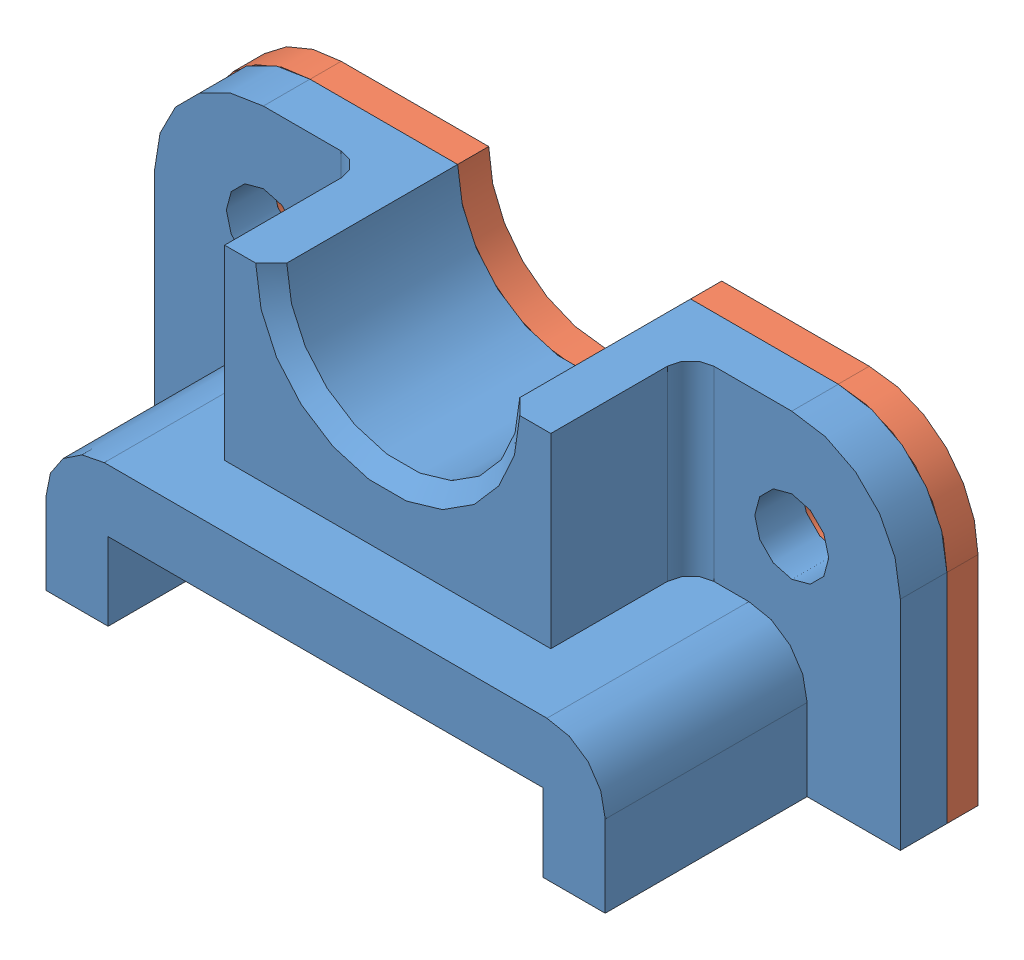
SolidWorks assembly Bearing Plate Assembly.SLDASM, configuration Default (file format 4700). Lengths in mm.
Overall size (101.6 44.45 38.1).
2 component instances, 2 part files, 3 mates.
Components (placement in the parent):
- Bearing Rest-1: Bearing Rest.SLDPRT [Default] at origin size (101.6 44.45 33.87)
- Bearing Plate-1: Bearing Plate.SLDPRT [Default] at (101.6 0 0) size (101.6 44.45 4.23)
Mates (geometry in assembly coordinates):
- Concentric1: concentric aligned: cylinder of Bearing Plate-1 through (50.8 44.45 -4.2333) axis (0 0 1) radius 15.875; cylinder of Bearing Rest-1 through (50.8 44.45 0) axis (0 0 1) radius 15.875
- Coincident1: coincident aligned: plane of Bearing Rest-1 through (101.6 44.45 6.35) normal (0 1 0); plane of Bearing Plate-1 through (34.925 44.45 -4.2333) normal (0 1 0)
- Coincident2: coincident anti-aligned: plane of Bearing Rest-1 through (0 0 0) normal (0 0 -1); plane of Bearing Plate-1 through (86.7833 29.6333 0) normal (0 0 1)
